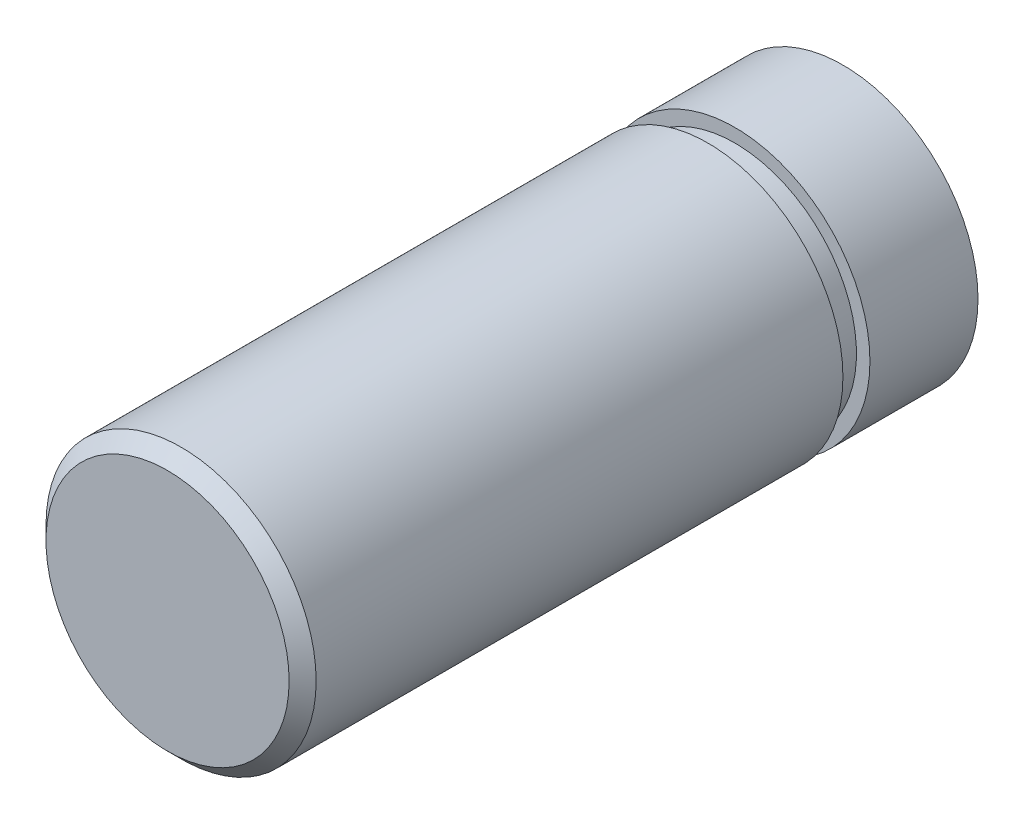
ISO-10303-21;
HEADER;
FILE_DESCRIPTION(('STEP AP214'),'2;1');
FILE_NAME('part.step','',(''),(''),'','','');
FILE_SCHEMA(('AUTOMOTIVE_DESIGN { 1 0 10303 214 1 1 1 1 }'));
ENDSEC;
DATA;
#1=APPLICATION_CONTEXT('core data for automotive mechanical design processes');
#2=APPLICATION_PROTOCOL_DEFINITION('international standard','automotive_design',2000,#1);
#3=PRODUCT_CONTEXT('',#1,'mechanical');
#4=PRODUCT('Part','Part','',(#3));
#5=PRODUCT_RELATED_PRODUCT_CATEGORY('part','',(#4));
#6=PRODUCT_DEFINITION_FORMATION('','',#4);
#7=PRODUCT_DEFINITION_CONTEXT('part definition',#1,'design');
#8=PRODUCT_DEFINITION('design','',#6,#7);
#9=PRODUCT_DEFINITION_SHAPE('','',#8);
#10=(LENGTH_UNIT() NAMED_UNIT(*) SI_UNIT(.MILLI.,.METRE.));
#11=(NAMED_UNIT(*) PLANE_ANGLE_UNIT() SI_UNIT($,.RADIAN.));
#12=(NAMED_UNIT(*) SI_UNIT($,.STERADIAN.) SOLID_ANGLE_UNIT());
#13=UNCERTAINTY_MEASURE_WITH_UNIT(LENGTH_MEASURE(1.E-05),#10,'distance_accuracy_value','');
#14=(GEOMETRIC_REPRESENTATION_CONTEXT(3) GLOBAL_UNCERTAINTY_ASSIGNED_CONTEXT((#13)) GLOBAL_UNIT_ASSIGNED_CONTEXT((#10,
#11,#12)) REPRESENTATION_CONTEXT('',''));
#15=CARTESIAN_POINT('',(0.,0.,0.));
#16=DIRECTION('',(0.,0.,1.));
#17=DIRECTION('',(1.,0.,0.));
#18=AXIS2_PLACEMENT_3D('',#15,#16,#17);
#19=CARTESIAN_POINT('',(0.,0.,50.));
#20=DIRECTION('',(0.,0.,-1.));
#21=DIRECTION('',(-1.,0.,0.));
#22=AXIS2_PLACEMENT_3D('',#19,#20,#21);
#23=CYLINDRICAL_SURFACE('',#22,10.);
#24=CARTESIAN_POINT('',(0.,0.,10.));
#25=DIRECTION('',(0.,0.,-1.));
#26=DIRECTION('',(-1.,0.,0.));
#27=AXIS2_PLACEMENT_3D('',#24,#25,#26);
#28=CIRCLE('',#27,10.);
#29=CARTESIAN_POINT('',(-10.,0.,10.));
#30=VERTEX_POINT('',#29);
#31=EDGE_CURVE('E47',#30,#30,#28,.T.);
#32=ORIENTED_EDGE('',*,*,#31,.F.);
#33=EDGE_LOOP('',(#32));
#34=FACE_BOUND('',#33,.T.);
#35=CARTESIAN_POINT('',(0.,0.,49.));
#36=DIRECTION('',(0.,0.,1.));
#37=DIRECTION('',(1.,0.,0.));
#38=AXIS2_PLACEMENT_3D('',#35,#36,#37);
#39=CIRCLE('',#38,10.);
#40=CARTESIAN_POINT('',(10.,0.,49.));
#41=VERTEX_POINT('',#40);
#42=EDGE_CURVE('E10',#41,#41,#39,.F.);
#43=ORIENTED_EDGE('',*,*,#42,.T.);
#44=EDGE_LOOP('',(#43));
#45=FACE_BOUND('',#44,.T.);
#46=ADVANCED_FACE('F25',(#34,#45),#23,.T.);
#47=CARTESIAN_POINT('',(0.,0.,50.));
#48=DIRECTION('',(0.,0.,1.));
#49=DIRECTION('',(1.,0.,0.));
#50=AXIS2_PLACEMENT_3D('',#47,#48,#49);
#51=PLANE('',#50);
#52=CARTESIAN_POINT('',(0.,0.,50.));
#53=DIRECTION('',(0.,0.,1.));
#54=DIRECTION('',(1.,0.,0.));
#55=AXIS2_PLACEMENT_3D('',#52,#53,#54);
#56=CIRCLE('',#55,9.00000000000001);
#57=CARTESIAN_POINT('',(9.00000000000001,0.,50.));
#58=VERTEX_POINT('',#57);
#59=EDGE_CURVE('E31',#58,#58,#56,.T.);
#60=ORIENTED_EDGE('',*,*,#59,.T.);
#61=EDGE_LOOP('',(#60));
#62=FACE_BOUND('',#61,.T.);
#63=ADVANCED_FACE('F78',(#62),#51,.T.);
#64=CARTESIAN_POINT('',(0.,0.,50.));
#65=DIRECTION('',(0.,0.,-1.));
#66=DIRECTION('',(-1.,0.,0.));
#67=AXIS2_PLACEMENT_3D('',#64,#65,#66);
#68=CONICAL_SURFACE('',#67,9.00000000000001,0.785398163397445);
#69=ORIENTED_EDGE('',*,*,#42,.F.);
#70=EDGE_LOOP('',(#69));
#71=FACE_BOUND('',#70,.T.);
#72=ORIENTED_EDGE('',*,*,#59,.F.);
#73=EDGE_LOOP('',(#72));
#74=FACE_BOUND('',#73,.T.);
#75=ADVANCED_FACE('F61',(#71,#74),#68,.T.);
#76=CARTESIAN_POINT('',(0.,10.,8.));
#77=DIRECTION('',(0.,0.,-1.));
#78=DIRECTION('',(-1.,0.,0.));
#79=AXIS2_PLACEMENT_3D('',#76,#77,#78);
#80=PLANE('',#79);
#81=CARTESIAN_POINT('',(0.,0.,8.));
#82=DIRECTION('',(0.,0.,-1.));
#83=DIRECTION('',(-1.,0.,0.));
#84=AXIS2_PLACEMENT_3D('',#81,#82,#83);
#85=CIRCLE('',#84,10.);
#86=CARTESIAN_POINT('',(-10.,0.,8.));
#87=VERTEX_POINT('',#86);
#88=EDGE_CURVE('E50',#87,#87,#85,.T.);
#89=ORIENTED_EDGE('',*,*,#88,.F.);
#90=EDGE_LOOP('',(#89));
#91=FACE_BOUND('',#90,.T.);
#92=CARTESIAN_POINT('',(0.,0.,8.));
#93=DIRECTION('',(0.,0.,-1.));
#94=DIRECTION('',(-1.,0.,0.));
#95=AXIS2_PLACEMENT_3D('',#92,#93,#94);
#96=CIRCLE('',#95,9.);
#97=CARTESIAN_POINT('',(-9.,0.,8.));
#98=VERTEX_POINT('',#97);
#99=EDGE_CURVE('E39',#98,#98,#96,.T.);
#100=ORIENTED_EDGE('',*,*,#99,.T.);
#101=EDGE_LOOP('',(#100));
#102=FACE_BOUND('',#101,.T.);
#103=ADVANCED_FACE('F57',(#91,#102),#80,.F.);
#104=CARTESIAN_POINT('',(0.,0.,-0.517171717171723));
#105=DIRECTION('',(0.,0.,-1.));
#106=DIRECTION('',(-1.,0.,0.));
#107=AXIS2_PLACEMENT_3D('',#104,#105,#106);
#108=CYLINDRICAL_SURFACE('',#107,9.);
#109=ORIENTED_EDGE('',*,*,#99,.F.);
#110=EDGE_LOOP('',(#109));
#111=FACE_BOUND('',#110,.T.);
#112=CARTESIAN_POINT('',(0.,0.,10.));
#113=DIRECTION('',(0.,0.,-1.));
#114=DIRECTION('',(-1.,0.,0.));
#115=AXIS2_PLACEMENT_3D('',#112,#113,#114);
#116=CIRCLE('',#115,9.);
#117=CARTESIAN_POINT('',(-9.,0.,10.));
#118=VERTEX_POINT('',#117);
#119=EDGE_CURVE('E44',#118,#118,#116,.T.);
#120=ORIENTED_EDGE('',*,*,#119,.T.);
#121=EDGE_LOOP('',(#120));
#122=FACE_BOUND('',#121,.T.);
#123=ADVANCED_FACE('F60',(#111,#122),#108,.T.);
#124=CARTESIAN_POINT('',(0.,10.,10.));
#125=DIRECTION('',(0.,0.,1.));
#126=DIRECTION('',(1.,0.,0.));
#127=AXIS2_PLACEMENT_3D('',#124,#125,#126);
#128=PLANE('',#127);
#129=ORIENTED_EDGE('',*,*,#119,.F.);
#130=EDGE_LOOP('',(#129));
#131=FACE_BOUND('',#130,.T.);
#132=ORIENTED_EDGE('',*,*,#31,.T.);
#133=EDGE_LOOP('',(#132));
#134=FACE_BOUND('',#133,.T.);
#135=ADVANCED_FACE('F67',(#131,#134),#128,.F.);
#136=CARTESIAN_POINT('',(0.,0.,0.));
#137=DIRECTION('',(0.,0.,1.));
#138=DIRECTION('',(1.,0.,0.));
#139=AXIS2_PLACEMENT_3D('',#136,#137,#138);
#140=PLANE('',#139);
#141=CARTESIAN_POINT('',(0.,0.,0.));
#142=DIRECTION('',(0.,0.,1.));
#143=DIRECTION('',(1.,0.,0.));
#144=AXIS2_PLACEMENT_3D('',#141,#142,#143);
#145=CIRCLE('',#144,10.);
#146=CARTESIAN_POINT('',(10.,0.,0.));
#147=VERTEX_POINT('',#146);
#148=EDGE_CURVE('E35',#147,#147,#145,.T.);
#149=ORIENTED_EDGE('',*,*,#148,.F.);
#150=EDGE_LOOP('',(#149));
#151=FACE_BOUND('',#150,.T.);
#152=ADVANCED_FACE('F73',(#151),#140,.F.);
#153=ORIENTED_EDGE('',*,*,#88,.T.);
#154=EDGE_LOOP('',(#153));
#155=FACE_BOUND('',#154,.T.);
#156=ORIENTED_EDGE('',*,*,#148,.T.);
#157=EDGE_LOOP('',(#156));
#158=FACE_BOUND('',#157,.T.);
#159=ADVANCED_FACE('F54',(#155,#158),#23,.T.);
#160=CLOSED_SHELL('',(#46,#63,#75,#103,#123,#135,#152,#159));
#161=MANIFOLD_SOLID_BREP('B2',#160);
#162=ADVANCED_BREP_SHAPE_REPRESENTATION('',(#18,#161),#14);
#163=SHAPE_DEFINITION_REPRESENTATION(#9,#162);
ENDSEC;
END-ISO-10303-21;
